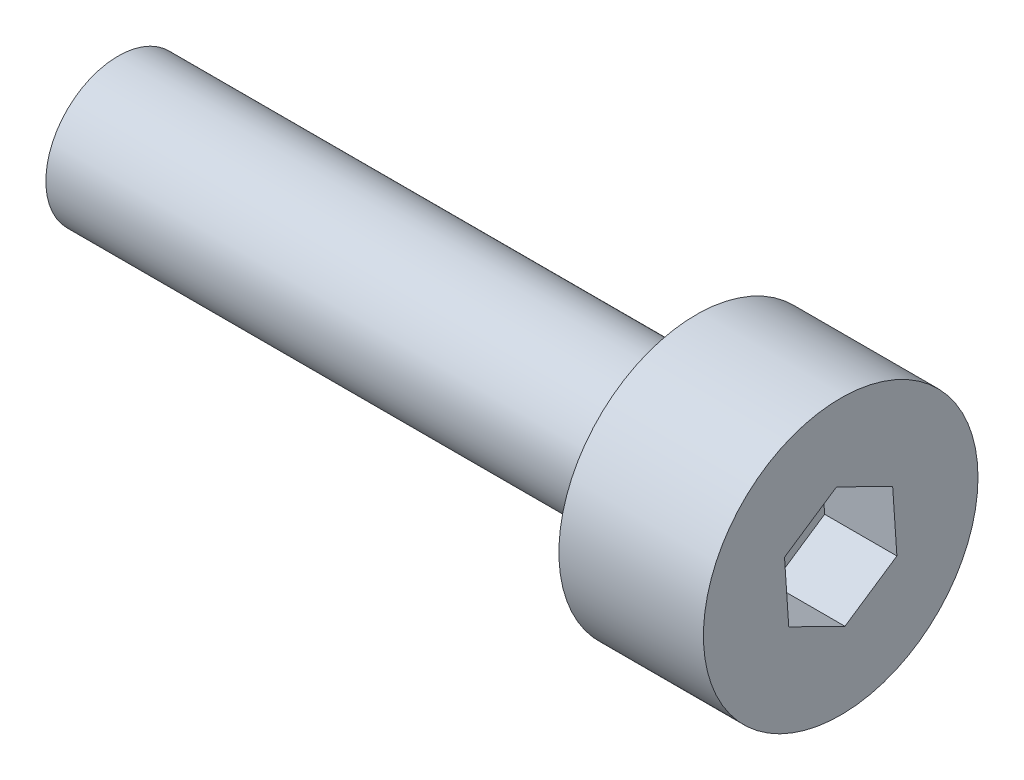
from build123d import *

# Parameters (mm, degrees)
ENL_V_MAT_EXTRU_1_DEPTH = 1


with BuildPart() as part:
    # Esquisse1 → R_volution1 (revolve)
    with BuildSketch(Plane.XY, mode=Mode.PRIVATE) as r_volution1_sk:
        Polygon((0, 0), (0, 1.9), (-2, 1.9), (-2, 1), (-10, 1), (-10, 0), align=None)
    revolve(r_volution1_sk.sketch.rotate(Axis((0, 0, 0), (-1, 0, 0)), 90), axis=Axis((0, 0, 0), (-1, 0, 0)))

    # Esquisse2 → Enl_v. mat.-Extru.1 (cut)
    with BuildSketch(Plane(origin=(0, 0, 0), x_dir=(0, 0, -1), z_dir=(1, 0, 0))):
        Polygon((0.777635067, -0.381160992), (0.718912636, 0.482871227), (-0.058722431, 0.864032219), (-0.777635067, 0.381160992), (-0.718912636, -0.482871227), (0.058722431, -0.864032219), align=None)
    extrude(amount=-ENL_V_MAT_EXTRU_1_DEPTH, mode=Mode.SUBTRACT)


solid = part.part
